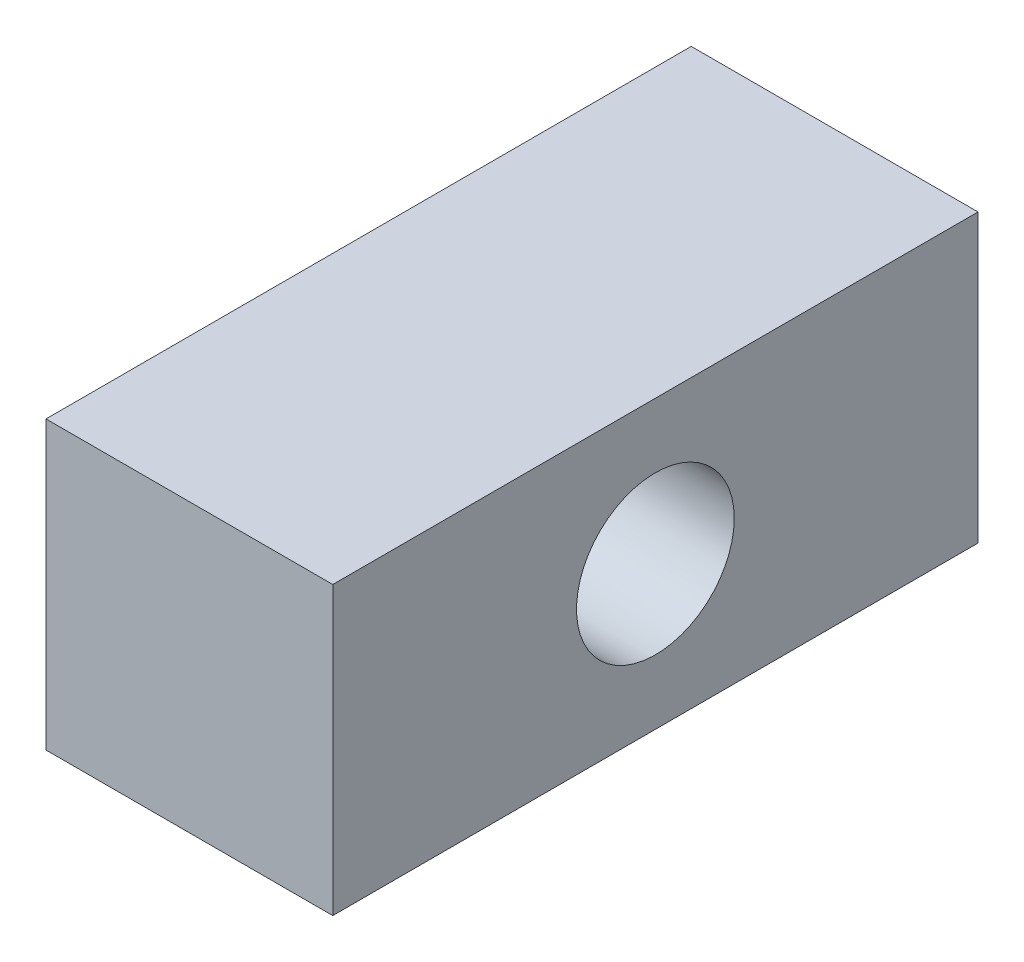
from build123d import *

# Parameters (mm, degrees)
ESQUISSE1_W        = 40
ESQUISSE1_H        = 40
BOSS_EXTRU_3_DEPTH = 90
D_GAGEMENT_M201_D  = 22


with BuildPart() as part:
    # Esquisse1 → Boss.-Extru.3 (new body)
    with BuildSketch(Plane.XY):
        with Locations((50, -38.5)):
            Rectangle(ESQUISSE1_W, ESQUISSE1_H)
    extrude(amount=BOSS_EXTRU_3_DEPTH)

    # D_gagement M201 (through all)
    with Locations(Plane(origin=(70, -86.242297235, 21.538837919), x_dir=(0, -1, 0), z_dir=(1, 0, 0))):
        with Locations((-47.742297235, -23.461162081)):
            Hole(D_GAGEMENT_M201_D / 2)


solid = part.part
